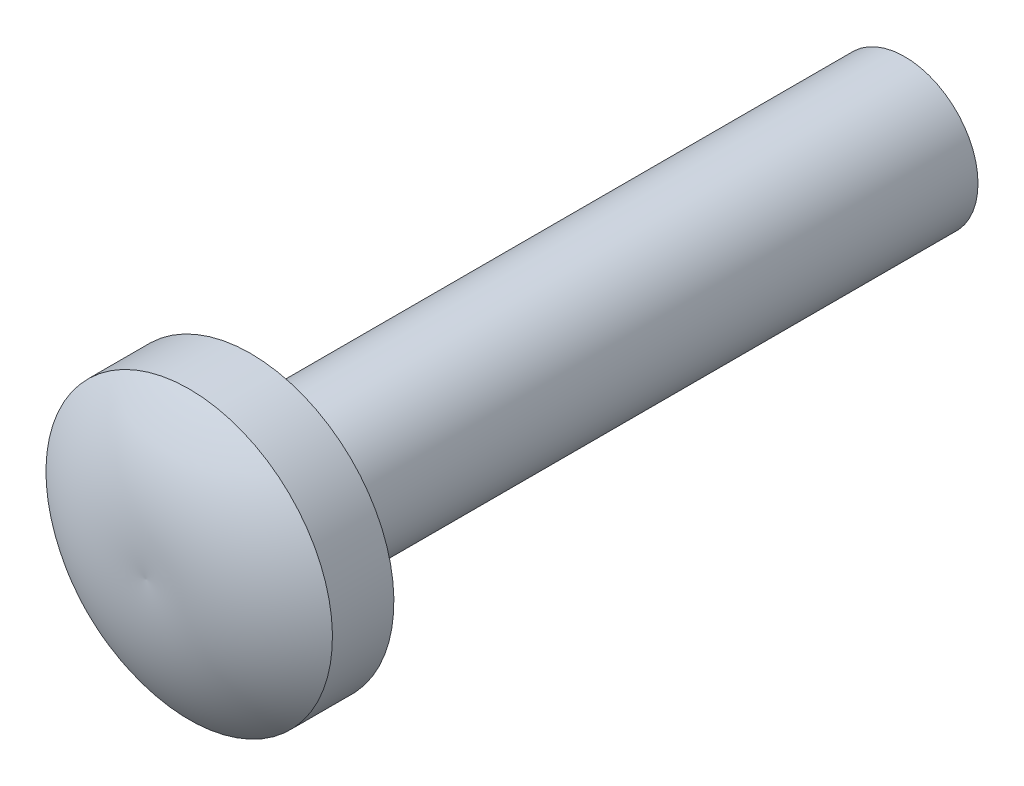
ISO-10303-21;
HEADER;
FILE_DESCRIPTION(('STEP AP214'),'2;1');
FILE_NAME('part.step','',(''),(''),'','','');
FILE_SCHEMA(('AUTOMOTIVE_DESIGN { 1 0 10303 214 1 1 1 1 }'));
ENDSEC;
DATA;
#1=APPLICATION_CONTEXT('core data for automotive mechanical design processes');
#2=APPLICATION_PROTOCOL_DEFINITION('international standard','automotive_design',2000,#1);
#3=PRODUCT_CONTEXT('',#1,'mechanical');
#4=PRODUCT('Part','Part','',(#3));
#5=PRODUCT_RELATED_PRODUCT_CATEGORY('part','',(#4));
#6=PRODUCT_DEFINITION_FORMATION('','',#4);
#7=PRODUCT_DEFINITION_CONTEXT('part definition',#1,'design');
#8=PRODUCT_DEFINITION('design','',#6,#7);
#9=PRODUCT_DEFINITION_SHAPE('','',#8);
#10=(LENGTH_UNIT() NAMED_UNIT(*) SI_UNIT(.MILLI.,.METRE.));
#11=(NAMED_UNIT(*) PLANE_ANGLE_UNIT() SI_UNIT($,.RADIAN.));
#12=(NAMED_UNIT(*) SI_UNIT($,.STERADIAN.) SOLID_ANGLE_UNIT());
#13=UNCERTAINTY_MEASURE_WITH_UNIT(LENGTH_MEASURE(1.E-05),#10,'distance_accuracy_value','');
#14=(GEOMETRIC_REPRESENTATION_CONTEXT(3) GLOBAL_UNCERTAINTY_ASSIGNED_CONTEXT((#13)) GLOBAL_UNIT_ASSIGNED_CONTEXT((#10,
#11,#12)) REPRESENTATION_CONTEXT('',''));
#15=CARTESIAN_POINT('',(0.,0.,0.));
#16=DIRECTION('',(0.,0.,1.));
#17=DIRECTION('',(1.,0.,0.));
#18=AXIS2_PLACEMENT_3D('',#15,#16,#17);
#19=CARTESIAN_POINT('',(0.,0.,12.7));
#20=DIRECTION('',(0.,0.,-1.));
#21=DIRECTION('',(-1.,0.,0.));
#22=AXIS2_PLACEMENT_3D('',#19,#20,#21);
#23=CYLINDRICAL_SURFACE('',#22,1.4224);
#24=CARTESIAN_POINT('',(0.,0.,12.7));
#25=DIRECTION('',(0.,0.,1.));
#26=DIRECTION('',(1.,0.,0.));
#27=AXIS2_PLACEMENT_3D('',#24,#25,#26);
#28=CIRCLE('',#27,1.4224);
#29=CARTESIAN_POINT('',(1.4224,0.,12.7));
#30=VERTEX_POINT('',#29);
#31=EDGE_CURVE('E11',#30,#30,#28,.T.);
#32=ORIENTED_EDGE('',*,*,#31,.F.);
#33=EDGE_LOOP('',(#32));
#34=FACE_BOUND('',#33,.T.);
#35=CARTESIAN_POINT('',(0.,0.,0.));
#36=DIRECTION('',(0.,0.,1.));
#37=DIRECTION('',(1.,0.,0.));
#38=AXIS2_PLACEMENT_3D('',#35,#36,#37);
#39=CIRCLE('',#38,1.4224);
#40=CARTESIAN_POINT('',(1.4224,0.,0.));
#41=VERTEX_POINT('',#40);
#42=EDGE_CURVE('E36',#41,#41,#39,.T.);
#43=ORIENTED_EDGE('',*,*,#42,.T.);
#44=EDGE_LOOP('',(#43));
#45=FACE_BOUND('',#44,.T.);
#46=ADVANCED_FACE('F33',(#34,#45),#23,.T.);
#47=CARTESIAN_POINT('',(0.,0.,0.));
#48=DIRECTION('',(0.,0.,1.));
#49=DIRECTION('',(1.,0.,0.));
#50=AXIS2_PLACEMENT_3D('',#47,#48,#49);
#51=PLANE('',#50);
#52=ORIENTED_EDGE('',*,*,#42,.F.);
#53=EDGE_LOOP('',(#52));
#54=FACE_BOUND('',#53,.T.);
#55=ADVANCED_FACE('F67',(#54),#51,.F.);
#56=CARTESIAN_POINT('',(0.,0.,12.7));
#57=DIRECTION('',(0.,0.,-1.));
#58=DIRECTION('',(0.,1.,0.));
#59=AXIS2_PLACEMENT_3D('',#56,#57,#58);
#60=PLANE('',#59);
#61=ORIENTED_EDGE('',*,*,#31,.T.);
#62=EDGE_LOOP('',(#61));
#63=FACE_BOUND('',#62,.T.);
#64=CARTESIAN_POINT('',(0.,0.,12.7));
#65=DIRECTION('',(0.,0.,-1.));
#66=DIRECTION('',(0.,1.,0.));
#67=AXIS2_PLACEMENT_3D('',#64,#65,#66);
#68=CIRCLE('',#67,2.7813);
#69=CARTESIAN_POINT('',(0.,2.7813,12.7));
#70=VERTEX_POINT('',#69);
#71=EDGE_CURVE('E52',#70,#70,#68,.T.);
#72=ORIENTED_EDGE('',*,*,#71,.T.);
#73=EDGE_LOOP('',(#72));
#74=FACE_BOUND('',#73,.T.);
#75=ADVANCED_FACE('F46',(#63,#74),#60,.T.);
#76=CARTESIAN_POINT('',(0.,2.7813,13.893093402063));
#77=CARTESIAN_POINT('',(0.,1.52671008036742,14.870102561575));
#78=CARTESIAN_POINT('',(0.,0.,14.732));
#79=B_SPLINE_CURVE_WITH_KNOTS('',2,(#76,#77,#78),.UNSPECIFIED.,.F.,.F.,(3,3),(0.,1.),.UNSPECIFIED.);
#80=CARTESIAN_POINT('',(0.,0.,12.7));
#81=DIRECTION('',(0.,0.,-1.));
#82=AXIS1_PLACEMENT('',#80,#81);
#83=SURFACE_OF_REVOLUTION('',#79,#82);
#84=CARTESIAN_POINT('',(0.,0.,14.732));
#85=VERTEX_POINT('',#84);
#86=VERTEX_LOOP('',#85);
#87=FACE_BOUND('',#86,.T.);
#88=CARTESIAN_POINT('',(0.,0.,13.893093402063));
#89=DIRECTION('',(0.,0.,-1.));
#90=DIRECTION('',(0.,1.,0.));
#91=AXIS2_PLACEMENT_3D('',#88,#89,#90);
#92=CIRCLE('',#91,2.7813);
#93=CARTESIAN_POINT('',(0.,2.7813,13.893093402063));
#94=VERTEX_POINT('',#93);
#95=EDGE_CURVE('E50',#94,#94,#92,.T.);
#96=ORIENTED_EDGE('',*,*,#95,.F.);
#97=EDGE_LOOP('',(#96));
#98=FACE_BOUND('',#97,.T.);
#99=ADVANCED_FACE('F42',(#87,#98),#83,.F.);
#100=CARTESIAN_POINT('',(0.,0.,12.7));
#101=DIRECTION('',(0.,0.,-1.));
#102=DIRECTION('',(0.,1.,0.));
#103=AXIS2_PLACEMENT_3D('',#100,#101,#102);
#104=CYLINDRICAL_SURFACE('',#103,2.7813);
#105=ORIENTED_EDGE('',*,*,#95,.T.);
#106=EDGE_LOOP('',(#105));
#107=FACE_BOUND('',#106,.T.);
#108=ORIENTED_EDGE('',*,*,#71,.F.);
#109=EDGE_LOOP('',(#108));
#110=FACE_BOUND('',#109,.T.);
#111=ADVANCED_FACE('F45',(#107,#110),#104,.T.);
#112=CLOSED_SHELL('',(#46,#55,#75,#99,#111));
#113=MANIFOLD_SOLID_BREP('B2',#112);
#114=ADVANCED_BREP_SHAPE_REPRESENTATION('',(#18,#113),#14);
#115=SHAPE_DEFINITION_REPRESENTATION(#9,#114);
ENDSEC;
END-ISO-10303-21;
